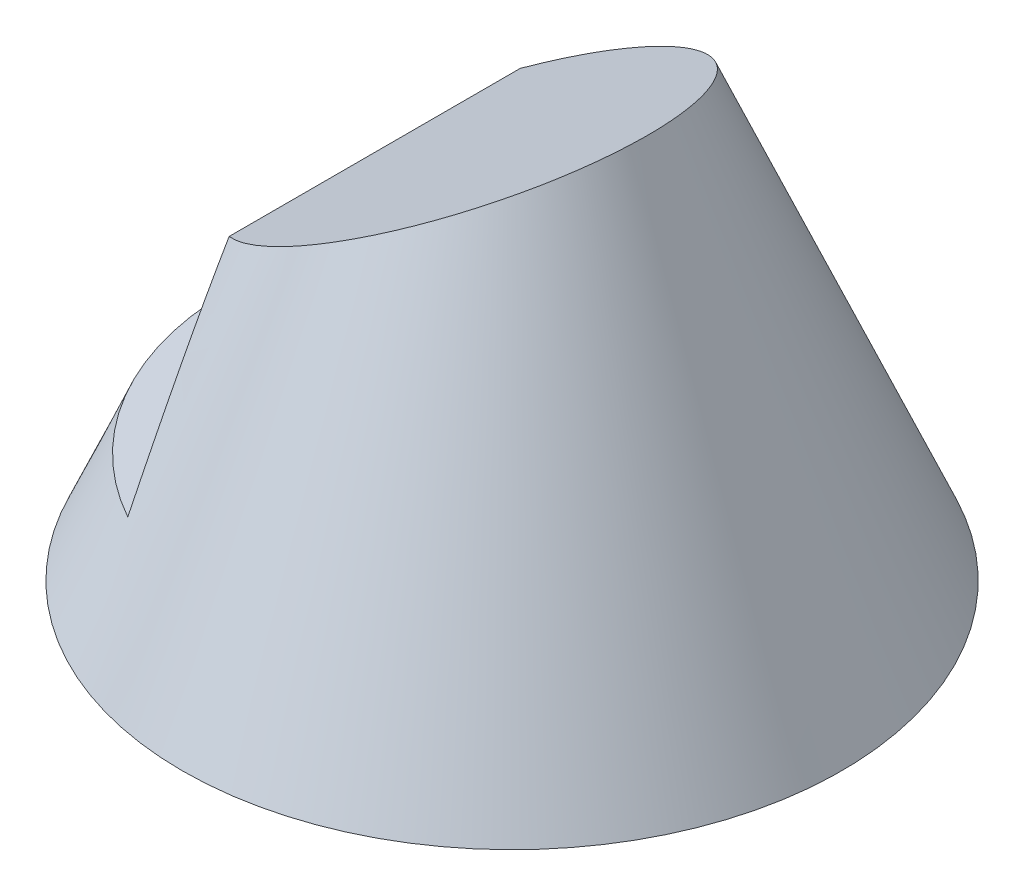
from build123d import *

# Parameters (mm, degrees)
CUT_EXTRUDE_1_DEPTH      = 66.482822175
CUT_EXTRUDE_1_DEPTH_BACK = 66.482822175


with BuildPart() as part:
    # Sketch 1 → Revolve 1 (revolve)
    with BuildSketch(Plane.XY, mode=Mode.PRIVATE) as revolve_1_sk:
        Polygon((0, 0), (-24, 0), (0, 56), align=None)
    revolve(revolve_1_sk.sketch.rotate(Axis((0, 0, 0), (0, -1, 0)), 90), axis=Axis((0, 0, 0), (0, -1, 0)))

    # Sketch 2 → Cut-Extrude 1 (cut, two sides: drawn at the far end of the back side and taken through both)
    with BuildSketch(Plane.XY.offset(-CUT_EXTRUDE_1_DEPTH_BACK)):
        Polygon((-195.13189871, 8), (-34.2201662, 8), (-10, 8), (-10, 22), (17.648031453, 37.315815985), (158.405620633, 115.289444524), (64.949297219, 423.244405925), (-288.588222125, 315.954961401), align=None)
    extrude(amount=CUT_EXTRUDE_1_DEPTH + CUT_EXTRUDE_1_DEPTH_BACK, mode=Mode.SUBTRACT)


solid = part.part
